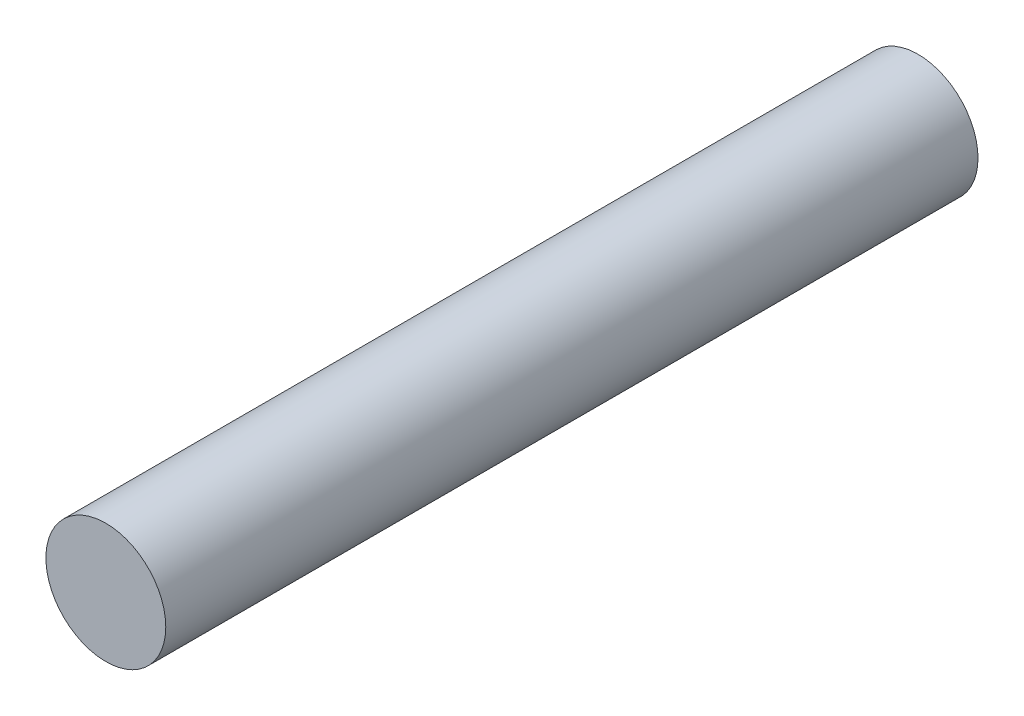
from build123d import *

# Parameters (mm, degrees)
SKIZZE1_R                       = 18.45
AUFSATZ_LINEAR_AUSTRAGEN1_DEPTH = 250


with BuildPart() as part:
    # Skizze1 → Aufsatz-Linear austragen1 (new body)
    with BuildSketch(Plane.XY):
        Circle(SKIZZE1_R)
    extrude(amount=AUFSATZ_LINEAR_AUSTRAGEN1_DEPTH)


solid = part.part
